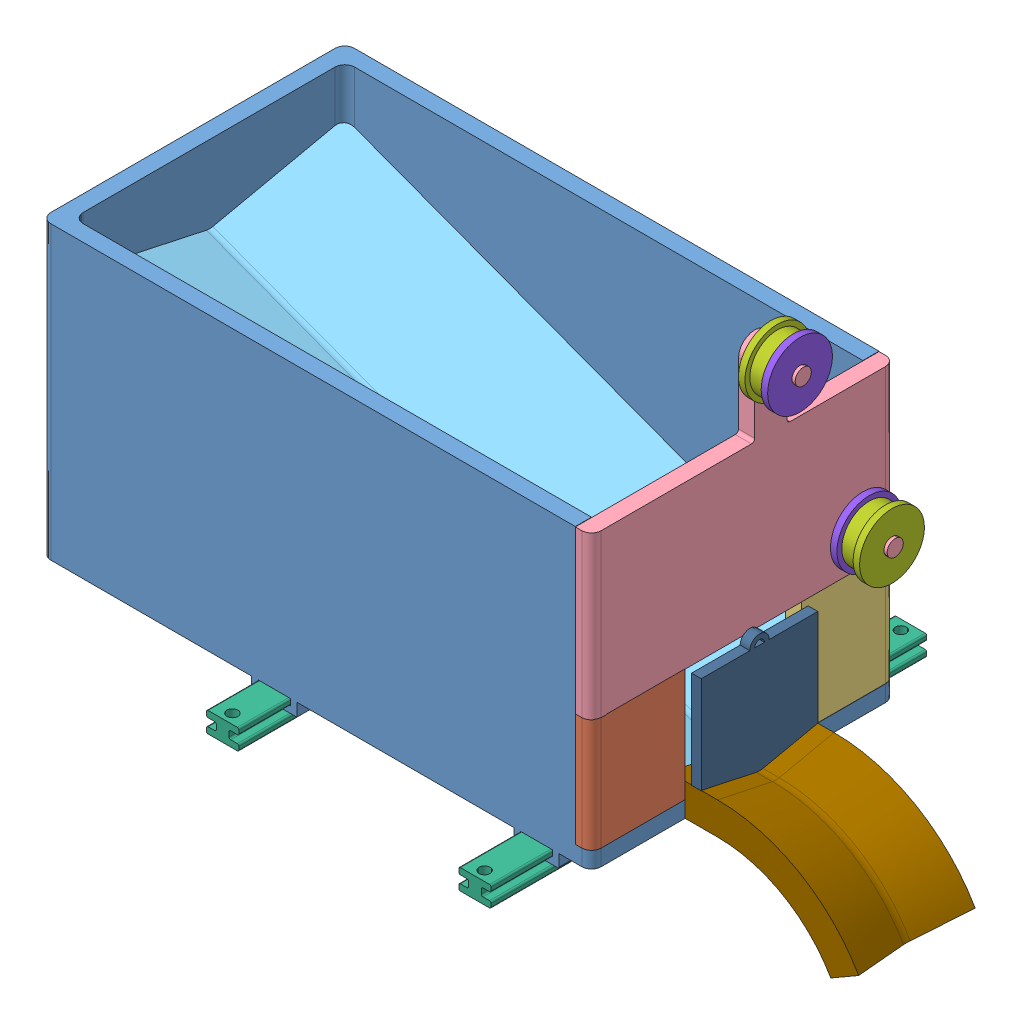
SolidWorks assembly insgesamt-neu.SLDASM, configuration 默认 (file format 6000). Lengths in mm.
Overall size (223.61 146.09 134.51).
17 component instances, 10 part files, 27 mates.
Components (placement in the parent):
- box-1: box.SLDPRT [默认] at origin size (170 94 93.8)
- wand-link-unter-2: wand-link-unter.SLDPRT [默认] at (85 4.9963 18) x (0 0 1) z (-1 0 0) size (28.9 37.8 5)
- wand-recht-unter-2: wand-recht-unter.SLDPRT [默认] at (85 40.0833 -18) x (0 0 -1) z (-1 0 0) size (28.9 37.8 5)
- wand-oben-1: wand-oben.SLDPRT [默认] at (80 64.893 0) x (0 0 -1) z (1 0 0) size (93.8 78 15)
- schiefer-1: schiefer.SLDPRT [默认] at (-80 5 -0.15) size (160 69.6 83.5)
- fester-1: fester.SLDPRT [默认] at (68 -3.15 -68.631) size (10 6.3 30)
- fester-2: fester.SLDPRT [默认] at (67.97 -3.15 65.8742) x (-1 0 0) z (0 0 -1) size (10 6.3 30)
- fester-3: fester.SLDPRT [默认] at (-13 -3.15 62.8068) x (-1 0 0) z (0 0 -1) size (10 6.3 30)
- fester-4: fester.SLDPRT [默认] at (-12.97 -3.15 -64.3521) size (10 6.3 30)
- rad-1: rad.SLDASM [默认] at (87 109.893 -8.5) x (0 -0.940663 -0.339342) z (0 -0.339342 0.940663) size (28.27 9 28.27)
  - rad-halb-1-1: rad-halb-1.SLDPRT [默认] at origin size (20 7 20)
  - rad-halb-2-1: rad-halb-2.SLDPRT [默认] at (0 7 0) x (-0.726706 0 -0.686948) z (-0.686948 0 0.726706) size (20 4.9 20)
- rad-2: rad.SLDASM [默认] at (92 49.893 -36.9) x (0 0.690749 0.723095) z (0 -0.723095 0.690749) size (28.27 9 28.27)
  - rad-halb-1-1: rad-halb-1.SLDPRT [默认] at origin size (20 7 20)
  - rad-halb-2-1: rad-halb-2.SLDPRT [默认] at (0 7 0) x (-0.726706 0 -0.686948) z (-0.686948 0 0.726706) size (20 4.9 20)
- bahn-1: bahn.SLDPRT [默认] at (80 0 0) size (58.61 30.15 42)
- Tuer-1: Tuer.SLDPRT [默认] at (90 39.8339 0) x (0 0 1) z (-1 0 0) size (36 36.72 3)
Mates (geometry in assembly coordinates):
- 重合2: coincident anti-aligned: plane of box-1 through (80 -93.9332 -46.9) normal (1 0 0); plane of wand-link-unter-2 through (80 4.9963 18) normal (-1 0 0)
- 重合3: coincident anti-aligned: plane of box-1 through (80 -93.9332 -46.9) normal (1 0 0); plane of wand-recht-unter-2 through (80 40.0833 -18) normal (-1 0 0)
- 重合7: coincident anti-aligned: plane of box-1 through (-80 90 -46.9) normal (1 0 0); plane of schiefer-1 through (-80 75 41.6) normal (-1 0 0)
- 重合8: coincident anti-aligned: plane of box-1 through (-85 90 -41.9) normal (0 0 1); plane of schiefer-1 through (-80 5 -41.9) normal (0 0 -1)
- 重合9: coincident anti-aligned: plane of box-1 through (0 0 0) normal (0 -1 0); plane of fester-4 through (-17.97 0 -34.3521) normal (0 1 0)
- 重合10: coincident anti-aligned: plane of box-1 through (-11 -4 53.3031) normal (-1 0 0); plane of fester-4 through (-11 -1.95 -34.3521) normal (1 0 0)
- 重合11: coincident anti-aligned: plane of box-1 through (0 0 0) normal (0 -1 0); plane of fester-1 through (63 0 -38.631) normal (0 1 0)
- 重合12: coincident anti-aligned: plane of box-1 through (63 -2 53.3031) normal (1 0 0); plane of fester-1 through (63 0 -38.631) normal (-1 0 0)
- 重合13: coincident anti-aligned: plane of box-1 through (0 0 0) normal (0 -1 0); plane of fester-3 through (-8 0 32.8068) normal (0 1 0)
- 重合14: coincident anti-aligned: plane of box-1 through (-18 -2 53.3031) normal (1 0 0); plane of fester-3 through (-18 0 32.8068) normal (-1 0 0)
- 重合15: coincident anti-aligned: plane of box-1 through (0 0 0) normal (0 -1 0); plane of fester-2 through (72.97 0 35.8742) normal (0 1 0)
- 重合16: coincident anti-aligned: plane of box-1 through (66 -4 53.3031) normal (1 0 0); plane of fester-2 through (66 -1.95 35.8742) normal (-1 0 0)
- 同心7: concentric anti-aligned: cylinder of wand-oben-1 through (95 109.893 -8.5) axis (-1 0 0) radius 2.5; cylinder of rad-1/rad-halb-1-1 through (85 109.893 -8.5) axis (1 0 0) radius 2.5
- 同心8: concentric anti-aligned: cylinder of wand-oben-1 through (95 49.893 -36.9) axis (-1 0 0) radius 2.5; cylinder of rad-2/rad-halb-2-1 through (85 49.893 -36.9) axis (1 0 0) radius 2.5
- 重合17: coincident anti-aligned: plane of wand-link-unter-2 through (83.5 36.9963 21.5) normal (-1 0 0); plane of wand-oben-1 through (83.5 36.893 25.5) normal (1 0 0)
- 重合20: coincident anti-aligned: plane of wand-link-unter-2 through (83.5 36.9963 21.5) normal (-1 0 0); plane of wand-oben-1 through (83.5 36.893 25.5) normal (1 0 0)
- 重合21: coincident aligned: plane of box-1 through (-85 90 46.9) normal (0 0 1); plane of wand-oben-1 through (85 39.893 46.9) normal (0 0 1)
- 重合22: coincident aligned: plane of box-1 through (-85 90 46.9) normal (0 0 1); plane of wand-link-unter-2 through (80 4.9963 46.9) normal (0 0 1)
- 重合23: coincident aligned: plane of box-1 through (-85 90 -46.9) normal (0 0 -1); plane of wand-recht-unter-2 through (80 40.0833 -46.9) normal (0 0 -1)
- 重合27: coincident anti-aligned: plane of box-1 through (0 5 0) normal (0 1 0); plane of schiefer-1 through (-80 5 41.6) normal (0 -1 0)
- 重合28: coincident anti-aligned: plane of box-1 through (80 -4 -18) normal (1 0 0); plane of bahn-1 through (80 11.2219 0) normal (-1 0 0)
- 重合29: coincident aligned: plane of box-1 through (0 0 0) normal (0 -1 0); plane of bahn-1 through (95 0 18) normal (0 -1 0)
- 重合30: coincident anti-aligned: plane of box-1 through (85 -4 -18) normal (0 0 1); plane of bahn-1 through (95 9.9393 -18) normal (0 0 -1)
- 重合31: coincident anti-aligned: plane of rad-1/rad-halb-1-1 through (87 109.893 -8.5) normal (1 0 0); plane of Tuer-1 through (87 11.1165 0) normal (-1 0 0)
- 重合32: coincident anti-aligned: plane of wand-link-unter-2 through (80 4.9963 18) normal (0 0 -1); plane of Tuer-1 through (87 39.8339 18) normal (0 0 1)
- 重合33: coincident anti-aligned: plane of wand-oben-1 through (85 64.893 0) normal (1 0 0); plane of rad-1/rad-halb-1-1 through (85 109.893 -8.5) normal (-1 0 0)
- 重合34: coincident anti-aligned: plane of wand-oben-1 through (85 64.893 0) normal (1 0 0); plane of rad-2/rad-halb-2-1 through (85 49.893 -36.9) normal (-1 0 0)
